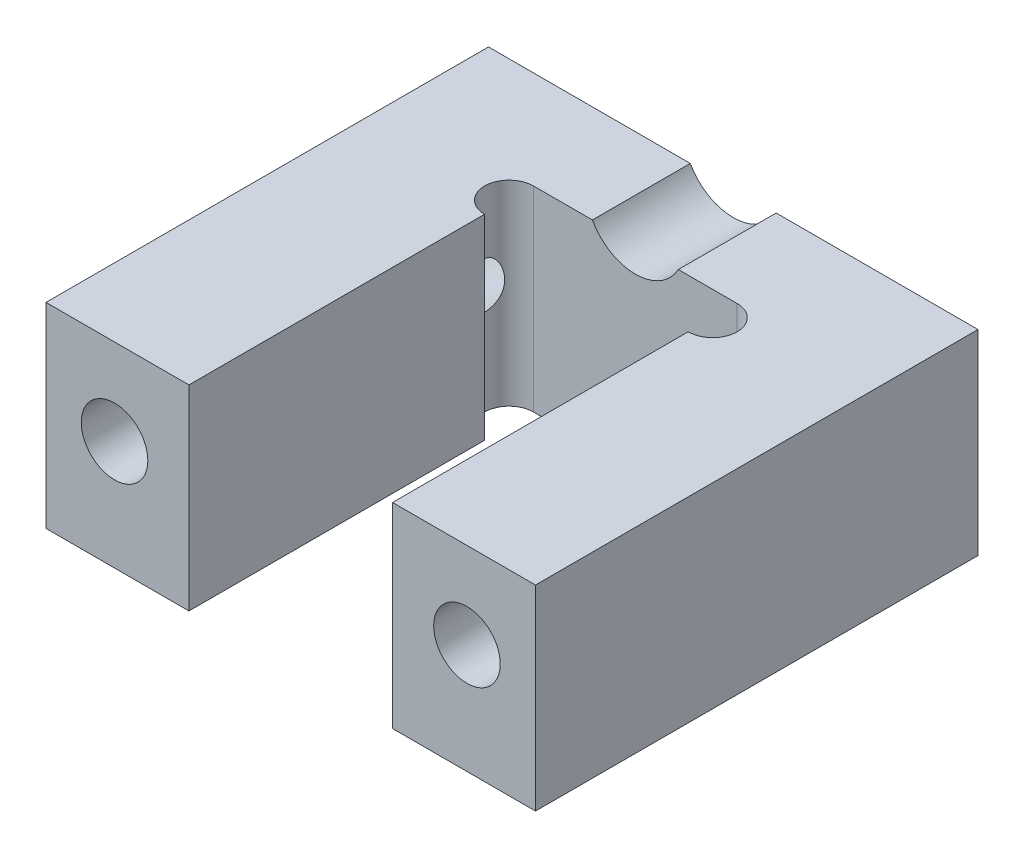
from build123d import *

# Parameters (mm, degrees)
SKETCH1_W          = 31.75
SKETCH1_H          = 12.7
EXTRUDE1_DEPTH     = 28.702
SKETCH2_W          = 13.208
SKETCH2_H          = 12.7
CUT_OUT_DEPTH      = 22.352
SKETCH3_R          = 2.159
THRU_HOLES_DEPTH   = 45.644790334
SKETCH4_R          = 3.5687
CBORE_DEPTH        = 17.78
CUT_EXTRUDE1_DEPTH = 45.644790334
SKETCH6_R          = 3.175
CUT_EXTRUDE2_DEPTH = 12.7


with BuildPart() as part:
    # Sketch1 → Extrude1 (new body)
    with BuildSketch(Plane.XY):
        with Locations((15.875, 6.35)):
            Rectangle(SKETCH1_W, SKETCH1_H)
    extrude(amount=EXTRUDE1_DEPTH)

    # Sketch2 → cut_out (cut)
    with BuildSketch(Plane.XY.offset(28.702)):
        with Locations((15.875, 6.35)):
            Rectangle(SKETCH2_W, SKETCH2_H)
    extrude(amount=-CUT_OUT_DEPTH, mode=Mode.SUBTRACT)

    # Sketch3 → thru_holes (cut, through all)
    with BuildSketch(Plane(origin=(0, 0, 0), x_dir=(-1, 0, 0), z_dir=(0, 0, -1))):
        with Locations((-27.305, 7.112)):
            Circle(SKETCH3_R)
        with Locations(Location((-4.445, 7.112, 0), (0, 0, 180))):
            Circle(SKETCH3_R)
    extrude(amount=-THRU_HOLES_DEPTH, mode=Mode.SUBTRACT)

    # Sketch4 → cbore (cut)
    with BuildSketch(Plane(origin=(0, 0, 0), x_dir=(-1, 0, 0), z_dir=(0, 0, -1))):
        with Locations((-27.305, 7.112)):
            Circle(SKETCH4_R)
        with Locations((-4.445, 7.112)):
            Circle(SKETCH4_R)
    extrude(amount=-CBORE_DEPTH, mode=Mode.SUBTRACT)

    # Sketch5 → Cut-Extrude1 (cut, through all)
    with BuildSketch(Plane(origin=(0, 12.7, 0), x_dir=(-1, 0, 0), z_dir=(0, 1, 0))):
        with BuildLine():
            Line((-22.479, 9.525), (-15.875, 9.526065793))
            Line((-15.875, 9.526065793), (-9.271, 9.525))
            ThreePointArc((-9.271, 9.525), (-7.6835, 7.9375), (-9.271, 6.35))
            Line((-9.271, 6.35), (-22.479, 6.35))
            ThreePointArc((-22.479, 6.35), (-24.0665, 7.9375), (-22.479, 9.525))
        make_face()
    extrude(amount=-CUT_EXTRUDE1_DEPTH, mode=Mode.SUBTRACT)

    # Sketch6 → Cut-Extrude2 (cut)
    with BuildSketch(Plane(origin=(0, 0, 0), x_dir=(-1, 0, 0), z_dir=(0, 0, -1))):
        with Locations((-15.875, 14.224)):
            Circle(SKETCH6_R)
    extrude(amount=-CUT_EXTRUDE2_DEPTH, mode=Mode.SUBTRACT)


solid = part.part
